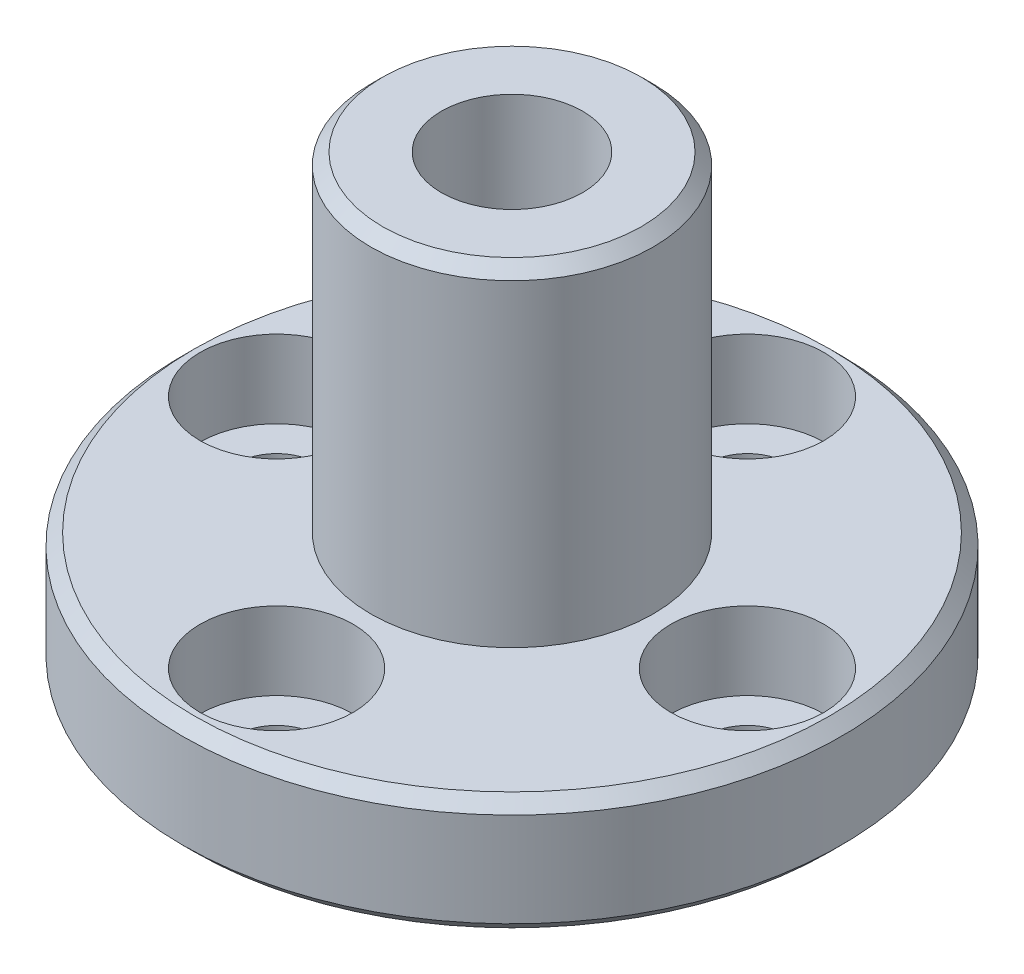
ISO-10303-21;
HEADER;
FILE_DESCRIPTION(('STEP AP214'),'2;1');
FILE_NAME('part.step','',(''),(''),'','','');
FILE_SCHEMA(('AUTOMOTIVE_DESIGN { 1 0 10303 214 1 1 1 1 }'));
ENDSEC;
DATA;
#1=APPLICATION_CONTEXT('core data for automotive mechanical design processes');
#2=APPLICATION_PROTOCOL_DEFINITION('international standard','automotive_design',2000,#1);
#3=PRODUCT_CONTEXT('',#1,'mechanical');
#4=PRODUCT('Part','Part','',(#3));
#5=PRODUCT_RELATED_PRODUCT_CATEGORY('part','',(#4));
#6=PRODUCT_DEFINITION_FORMATION('','',#4);
#7=PRODUCT_DEFINITION_CONTEXT('part definition',#1,'design');
#8=PRODUCT_DEFINITION('design','',#6,#7);
#9=PRODUCT_DEFINITION_SHAPE('','',#8);
#10=(LENGTH_UNIT() NAMED_UNIT(*) SI_UNIT(.MILLI.,.METRE.));
#11=(NAMED_UNIT(*) PLANE_ANGLE_UNIT() SI_UNIT($,.RADIAN.));
#12=(NAMED_UNIT(*) SI_UNIT($,.STERADIAN.) SOLID_ANGLE_UNIT());
#13=UNCERTAINTY_MEASURE_WITH_UNIT(LENGTH_MEASURE(1.E-05),#10,'distance_accuracy_value','');
#14=(GEOMETRIC_REPRESENTATION_CONTEXT(3) GLOBAL_UNCERTAINTY_ASSIGNED_CONTEXT((#13)) GLOBAL_UNIT_ASSIGNED_CONTEXT((#10,
#11,#12)) REPRESENTATION_CONTEXT('',''));
#15=CARTESIAN_POINT('',(0.,0.,0.));
#16=DIRECTION('',(0.,0.,1.));
#17=DIRECTION('',(1.,0.,0.));
#18=AXIS2_PLACEMENT_3D('',#15,#16,#17);
#19=CARTESIAN_POINT('',(0.,0.,0.));
#20=DIRECTION('',(0.,1.,0.));
#21=DIRECTION('',(0.,0.,1.));
#22=AXIS2_PLACEMENT_3D('',#19,#20,#21);
#23=CONICAL_SURFACE('',#22,13.5,0.785398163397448);
#24=CARTESIAN_POINT('',(0.,0.499999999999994,0.));
#25=DIRECTION('',(0.,1.,0.));
#26=DIRECTION('',(0.,0.,1.));
#27=AXIS2_PLACEMENT_3D('',#24,#25,#26);
#28=CIRCLE('',#27,14.);
#29=CARTESIAN_POINT('',(0.,0.499999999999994,14.));
#30=VERTEX_POINT('',#29);
#31=CARTESIAN_POINT('',(0.,0.5,-14.));
#32=VERTEX_POINT('',#31);
#33=EDGE_CURVE('E259',#30,#32,#28,.T.);
#34=ORIENTED_EDGE('',*,*,#33,.F.);
#35=CARTESIAN_POINT('',(0.,0.499999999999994,0.));
#36=DIRECTION('',(0.,1.,0.));
#37=DIRECTION('',(0.,0.,1.));
#38=AXIS2_PLACEMENT_3D('',#35,#36,#37);
#39=CIRCLE('',#38,14.);
#40=EDGE_CURVE('E254',#32,#30,#39,.T.);
#41=ORIENTED_EDGE('',*,*,#40,.F.);
#42=DIRECTION('',(0.,-0.707106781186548,0.707106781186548));
#43=VECTOR('',#42,1.);
#44=CARTESIAN_POINT('',(0.,0.,-13.5));
#45=LINE('',#44,#43);
#46=CARTESIAN_POINT('',(0.,0.,-13.5));
#47=VERTEX_POINT('',#46);
#48=EDGE_CURVE('E10',#32,#47,#45,.T.);
#49=ORIENTED_EDGE('',*,*,#48,.T.);
#50=CARTESIAN_POINT('',(0.,0.,0.));
#51=DIRECTION('',(0.,-1.,0.));
#52=DIRECTION('',(0.,0.,1.));
#53=AXIS2_PLACEMENT_3D('',#50,#51,#52);
#54=CIRCLE('',#53,13.5);
#55=CARTESIAN_POINT('',(0.,0.,13.5));
#56=VERTEX_POINT('',#55);
#57=EDGE_CURVE('E241',#56,#47,#54,.T.);
#58=ORIENTED_EDGE('',*,*,#57,.F.);
#59=CARTESIAN_POINT('',(0.,0.,0.));
#60=DIRECTION('',(0.,-1.,0.));
#61=DIRECTION('',(0.,0.,1.));
#62=AXIS2_PLACEMENT_3D('',#59,#60,#61);
#63=CIRCLE('',#62,13.5);
#64=EDGE_CURVE('E238',#47,#56,#63,.T.);
#65=ORIENTED_EDGE('',*,*,#64,.F.);
#66=ORIENTED_EDGE('',*,*,#48,.F.);
#67=EDGE_LOOP('',(#34,#41,#49,#58,#65,#66));
#68=FACE_BOUND('',#67,.T.);
#69=ADVANCED_FACE('F16',(#68),#23,.T.);
#70=CARTESIAN_POINT('',(0.,4.5,0.));
#71=DIRECTION('',(0.,-1.,0.));
#72=DIRECTION('',(0.,0.,-1.));
#73=AXIS2_PLACEMENT_3D('',#70,#71,#72);
#74=CONICAL_SURFACE('',#73,14.,0.785398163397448);
#75=CARTESIAN_POINT('',(0.,4.5,0.));
#76=DIRECTION('',(0.,-1.,0.));
#77=DIRECTION('',(0.,0.,-1.));
#78=AXIS2_PLACEMENT_3D('',#75,#76,#77);
#79=CIRCLE('',#78,14.);
#80=CARTESIAN_POINT('',(0.,4.5,-14.));
#81=VERTEX_POINT('',#80);
#82=CARTESIAN_POINT('',(0.,4.5,14.));
#83=VERTEX_POINT('',#82);
#84=EDGE_CURVE('E309',#81,#83,#79,.T.);
#85=ORIENTED_EDGE('',*,*,#84,.F.);
#86=CARTESIAN_POINT('',(0.,4.5,0.));
#87=DIRECTION('',(0.,-1.,0.));
#88=DIRECTION('',(0.,0.,-1.));
#89=AXIS2_PLACEMENT_3D('',#86,#87,#88);
#90=CIRCLE('',#89,14.);
#91=EDGE_CURVE('E305',#83,#81,#90,.T.);
#92=ORIENTED_EDGE('',*,*,#91,.F.);
#93=DIRECTION('',(0.,0.707106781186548,-0.707106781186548));
#94=VECTOR('',#93,1.);
#95=CARTESIAN_POINT('',(0.,4.5,14.));
#96=LINE('',#95,#94);
#97=CARTESIAN_POINT('',(0.,5.,13.5));
#98=VERTEX_POINT('',#97);
#99=EDGE_CURVE('E24',#83,#98,#96,.T.);
#100=ORIENTED_EDGE('',*,*,#99,.T.);
#101=CARTESIAN_POINT('',(0.,5.,0.));
#102=DIRECTION('',(0.,1.,0.));
#103=DIRECTION('',(0.,0.,-1.));
#104=AXIS2_PLACEMENT_3D('',#101,#102,#103);
#105=CIRCLE('',#104,13.5);
#106=CARTESIAN_POINT('',(0.,5.,-13.5));
#107=VERTEX_POINT('',#106);
#108=EDGE_CURVE('E338',#107,#98,#105,.T.);
#109=ORIENTED_EDGE('',*,*,#108,.F.);
#110=CARTESIAN_POINT('',(0.,5.,0.));
#111=DIRECTION('',(0.,1.,0.));
#112=DIRECTION('',(0.,0.,-1.));
#113=AXIS2_PLACEMENT_3D('',#110,#111,#112);
#114=CIRCLE('',#113,13.5);
#115=EDGE_CURVE('E342',#98,#107,#114,.T.);
#116=ORIENTED_EDGE('',*,*,#115,.F.);
#117=ORIENTED_EDGE('',*,*,#99,.F.);
#118=EDGE_LOOP('',(#85,#92,#100,#109,#116,#117));
#119=FACE_BOUND('',#118,.T.);
#120=ADVANCED_FACE('F468',(#119),#74,.T.);
#121=CARTESIAN_POINT('',(0.,18.5,0.));
#122=DIRECTION('',(0.,-1.,0.));
#123=DIRECTION('',(0.,0.,-1.));
#124=AXIS2_PLACEMENT_3D('',#121,#122,#123);
#125=CONICAL_SURFACE('',#124,6.,0.785398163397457);
#126=CARTESIAN_POINT('',(0.,18.5,0.));
#127=DIRECTION('',(0.,-1.,0.));
#128=DIRECTION('',(0.,0.,-1.));
#129=AXIS2_PLACEMENT_3D('',#126,#127,#128);
#130=CIRCLE('',#129,6.);
#131=CARTESIAN_POINT('',(0.,18.5,-6.));
#132=VERTEX_POINT('',#131);
#133=CARTESIAN_POINT('',(0.,18.5,6.));
#134=VERTEX_POINT('',#133);
#135=EDGE_CURVE('E388',#132,#134,#130,.T.);
#136=ORIENTED_EDGE('',*,*,#135,.F.);
#137=CARTESIAN_POINT('',(0.,18.5,0.));
#138=DIRECTION('',(0.,-1.,0.));
#139=DIRECTION('',(0.,0.,-1.));
#140=AXIS2_PLACEMENT_3D('',#137,#138,#139);
#141=CIRCLE('',#140,6.);
#142=EDGE_CURVE('E381',#134,#132,#141,.T.);
#143=ORIENTED_EDGE('',*,*,#142,.F.);
#144=DIRECTION('',(0.,0.707106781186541,-0.707106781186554));
#145=VECTOR('',#144,1.);
#146=CARTESIAN_POINT('',(0.,18.5,6.));
#147=LINE('',#146,#145);
#148=CARTESIAN_POINT('',(0.,19.,5.5));
#149=VERTEX_POINT('',#148);
#150=EDGE_CURVE('E384',#134,#149,#147,.T.);
#151=ORIENTED_EDGE('',*,*,#150,.T.);
#152=CARTESIAN_POINT('',(0.,19.,0.));
#153=DIRECTION('',(0.,1.,0.));
#154=DIRECTION('',(0.,0.,-1.));
#155=AXIS2_PLACEMENT_3D('',#152,#153,#154);
#156=CIRCLE('',#155,5.5);
#157=CARTESIAN_POINT('',(0.,19.,-5.5));
#158=VERTEX_POINT('',#157);
#159=EDGE_CURVE('E392',#158,#149,#156,.T.);
#160=ORIENTED_EDGE('',*,*,#159,.F.);
#161=CARTESIAN_POINT('',(0.,19.,0.));
#162=DIRECTION('',(0.,1.,0.));
#163=DIRECTION('',(0.,0.,-1.));
#164=AXIS2_PLACEMENT_3D('',#161,#162,#163);
#165=CIRCLE('',#164,5.5);
#166=EDGE_CURVE('E396',#149,#158,#165,.T.);
#167=ORIENTED_EDGE('',*,*,#166,.F.);
#168=ORIENTED_EDGE('',*,*,#150,.F.);
#169=EDGE_LOOP('',(#136,#143,#151,#160,#167,#168));
#170=FACE_BOUND('',#169,.T.);
#171=ADVANCED_FACE('F492',(#170),#125,.T.);
#172=CARTESIAN_POINT('',(0.,5.,-10.));
#173=DIRECTION('',(0.,1.,0.));
#174=DIRECTION('',(0.,0.,1.));
#175=AXIS2_PLACEMENT_3D('',#172,#173,#174);
#176=CYLINDRICAL_SURFACE('',#175,3.25);
#177=CARTESIAN_POINT('',(0.,1.7,-10.));
#178=DIRECTION('',(0.,1.,0.));
#179=DIRECTION('',(0.,0.,1.));
#180=AXIS2_PLACEMENT_3D('',#177,#178,#179);
#181=CIRCLE('',#180,3.25);
#182=CARTESIAN_POINT('',(0.,1.7,-6.75));
#183=VERTEX_POINT('',#182);
#184=CARTESIAN_POINT('',(0.,1.7,-13.25));
#185=VERTEX_POINT('',#184);
#186=EDGE_CURVE('E352',#183,#185,#181,.T.);
#187=ORIENTED_EDGE('',*,*,#186,.F.);
#188=CARTESIAN_POINT('',(0.,1.7,-10.));
#189=DIRECTION('',(0.,1.,0.));
#190=DIRECTION('',(0.,0.,1.));
#191=AXIS2_PLACEMENT_3D('',#188,#189,#190);
#192=CIRCLE('',#191,3.25);
#193=EDGE_CURVE('E44',#185,#183,#192,.T.);
#194=ORIENTED_EDGE('',*,*,#193,.F.);
#195=DIRECTION('',(0.,1.,0.));
#196=VECTOR('',#195,1.);
#197=CARTESIAN_POINT('',(0.,5.,-13.25));
#198=LINE('',#197,#196);
#199=CARTESIAN_POINT('',(0.,5.,-13.25));
#200=VERTEX_POINT('',#199);
#201=EDGE_CURVE('E36',#185,#200,#198,.T.);
#202=ORIENTED_EDGE('',*,*,#201,.T.);
#203=CARTESIAN_POINT('',(0.,5.,-10.));
#204=DIRECTION('',(0.,1.,0.));
#205=DIRECTION('',(0.,0.,1.));
#206=AXIS2_PLACEMENT_3D('',#203,#204,#205);
#207=CIRCLE('',#206,3.25);
#208=CARTESIAN_POINT('',(0.,5.,-6.75));
#209=VERTEX_POINT('',#208);
#210=EDGE_CURVE('E348',#200,#209,#207,.T.);
#211=ORIENTED_EDGE('',*,*,#210,.T.);
#212=CARTESIAN_POINT('',(0.,5.,-10.));
#213=DIRECTION('',(0.,1.,0.));
#214=DIRECTION('',(0.,0.,1.));
#215=AXIS2_PLACEMENT_3D('',#212,#213,#214);
#216=CIRCLE('',#215,3.25);
#217=EDGE_CURVE('E345',#209,#200,#216,.T.);
#218=ORIENTED_EDGE('',*,*,#217,.T.);
#219=ORIENTED_EDGE('',*,*,#201,.F.);
#220=EDGE_LOOP('',(#187,#194,#202,#211,#218,#219));
#221=FACE_BOUND('',#220,.T.);
#222=ADVANCED_FACE('F496',(#221),#176,.F.);
#223=CARTESIAN_POINT('',(1.7,1.7,-10.));
#224=DIRECTION('',(0.,-1.,0.));
#225=DIRECTION('',(0.,0.,-1.));
#226=AXIS2_PLACEMENT_3D('',#223,#224,#225);
#227=PLANE('',#226);
#228=CARTESIAN_POINT('',(0.,1.7,-10.));
#229=DIRECTION('',(0.,1.,0.));
#230=DIRECTION('',(0.,0.,1.));
#231=AXIS2_PLACEMENT_3D('',#228,#229,#230);
#232=CIRCLE('',#231,1.7);
#233=CARTESIAN_POINT('',(0.,1.7,-8.3));
#234=VERTEX_POINT('',#233);
#235=CARTESIAN_POINT('',(0.,1.7,-11.7));
#236=VERTEX_POINT('',#235);
#237=EDGE_CURVE('E349',#234,#236,#232,.T.);
#238=ORIENTED_EDGE('',*,*,#237,.F.);
#239=CARTESIAN_POINT('',(0.,1.7,-10.));
#240=DIRECTION('',(0.,1.,0.));
#241=DIRECTION('',(0.,0.,1.));
#242=AXIS2_PLACEMENT_3D('',#239,#240,#241);
#243=CIRCLE('',#242,1.7);
#244=EDGE_CURVE('E353',#236,#234,#243,.T.);
#245=ORIENTED_EDGE('',*,*,#244,.F.);
#246=EDGE_LOOP('',(#238,#245));
#247=FACE_BOUND('',#246,.T.);
#248=ORIENTED_EDGE('',*,*,#186,.T.);
#249=ORIENTED_EDGE('',*,*,#193,.T.);
#250=EDGE_LOOP('',(#248,#249));
#251=FACE_BOUND('',#250,.T.);
#252=ADVANCED_FACE('F502',(#247,#251),#227,.F.);
#253=CARTESIAN_POINT('',(0.,5.,-10.));
#254=DIRECTION('',(0.,1.,0.));
#255=DIRECTION('',(0.,0.,1.));
#256=AXIS2_PLACEMENT_3D('',#253,#254,#255);
#257=CYLINDRICAL_SURFACE('',#256,1.7);
#258=CARTESIAN_POINT('',(0.,0.,-10.));
#259=DIRECTION('',(0.,1.,0.));
#260=DIRECTION('',(0.,0.,1.));
#261=AXIS2_PLACEMENT_3D('',#258,#259,#260);
#262=CIRCLE('',#261,1.7);
#263=CARTESIAN_POINT('',(0.,0.,-8.3));
#264=VERTEX_POINT('',#263);
#265=CARTESIAN_POINT('',(0.,0.,-11.7));
#266=VERTEX_POINT('',#265);
#267=EDGE_CURVE('E244',#264,#266,#262,.T.);
#268=ORIENTED_EDGE('',*,*,#267,.F.);
#269=CARTESIAN_POINT('',(0.,0.,-10.));
#270=DIRECTION('',(0.,1.,0.));
#271=DIRECTION('',(0.,0.,1.));
#272=AXIS2_PLACEMENT_3D('',#269,#270,#271);
#273=CIRCLE('',#272,1.7);
#274=EDGE_CURVE('E274',#266,#264,#273,.T.);
#275=ORIENTED_EDGE('',*,*,#274,.F.);
#276=DIRECTION('',(0.,1.,0.));
#277=VECTOR('',#276,1.);
#278=CARTESIAN_POINT('',(0.,5.,-11.7));
#279=LINE('',#278,#277);
#280=EDGE_CURVE('E449',#266,#236,#279,.T.);
#281=ORIENTED_EDGE('',*,*,#280,.T.);
#282=ORIENTED_EDGE('',*,*,#244,.T.);
#283=ORIENTED_EDGE('',*,*,#237,.T.);
#284=ORIENTED_EDGE('',*,*,#280,.F.);
#285=EDGE_LOOP('',(#268,#275,#281,#282,#283,#284));
#286=FACE_BOUND('',#285,.T.);
#287=ADVANCED_FACE('F505',(#286),#257,.F.);
#288=CARTESIAN_POINT('',(10.,5.,0.));
#289=DIRECTION('',(0.,1.,0.));
#290=DIRECTION('',(0.,0.,1.));
#291=AXIS2_PLACEMENT_3D('',#288,#289,#290);
#292=CYLINDRICAL_SURFACE('',#291,3.25);
#293=CARTESIAN_POINT('',(10.,1.7,0.));
#294=DIRECTION('',(0.,1.,0.));
#295=DIRECTION('',(0.,0.,1.));
#296=AXIS2_PLACEMENT_3D('',#293,#294,#295);
#297=CIRCLE('',#296,3.25);
#298=CARTESIAN_POINT('',(10.,1.7,3.25));
#299=VERTEX_POINT('',#298);
#300=CARTESIAN_POINT('',(10.,1.7,-3.25));
#301=VERTEX_POINT('',#300);
#302=EDGE_CURVE('E431',#299,#301,#297,.T.);
#303=ORIENTED_EDGE('',*,*,#302,.F.);
#304=CARTESIAN_POINT('',(10.,1.7,0.));
#305=DIRECTION('',(0.,1.,0.));
#306=DIRECTION('',(0.,0.,1.));
#307=AXIS2_PLACEMENT_3D('',#304,#305,#306);
#308=CIRCLE('',#307,3.25);
#309=EDGE_CURVE('E427',#301,#299,#308,.T.);
#310=ORIENTED_EDGE('',*,*,#309,.F.);
#311=DIRECTION('',(0.,1.,0.));
#312=VECTOR('',#311,1.);
#313=CARTESIAN_POINT('',(10.,5.,-3.25));
#314=LINE('',#313,#312);
#315=CARTESIAN_POINT('',(10.,5.,-3.25));
#316=VERTEX_POINT('',#315);
#317=EDGE_CURVE('E430',#301,#316,#314,.T.);
#318=ORIENTED_EDGE('',*,*,#317,.T.);
#319=CARTESIAN_POINT('',(10.,5.,0.));
#320=DIRECTION('',(0.,1.,0.));
#321=DIRECTION('',(0.,0.,1.));
#322=AXIS2_PLACEMENT_3D('',#319,#320,#321);
#323=CIRCLE('',#322,3.25);
#324=CARTESIAN_POINT('',(10.,5.,3.25));
#325=VERTEX_POINT('',#324);
#326=EDGE_CURVE('E280',#316,#325,#323,.T.);
#327=ORIENTED_EDGE('',*,*,#326,.T.);
#328=CARTESIAN_POINT('',(10.,5.,0.));
#329=DIRECTION('',(0.,1.,0.));
#330=DIRECTION('',(0.,0.,1.));
#331=AXIS2_PLACEMENT_3D('',#328,#329,#330);
#332=CIRCLE('',#331,3.25);
#333=EDGE_CURVE('E284',#325,#316,#332,.T.);
#334=ORIENTED_EDGE('',*,*,#333,.T.);
#335=ORIENTED_EDGE('',*,*,#317,.F.);
#336=EDGE_LOOP('',(#303,#310,#318,#327,#334,#335));
#337=FACE_BOUND('',#336,.T.);
#338=ADVANCED_FACE('F509',(#337),#292,.F.);
#339=CARTESIAN_POINT('',(11.7,1.7,0.));
#340=DIRECTION('',(0.,-1.,0.));
#341=DIRECTION('',(0.,0.,-1.));
#342=AXIS2_PLACEMENT_3D('',#339,#340,#341);
#343=PLANE('',#342);
#344=CARTESIAN_POINT('',(10.,1.7,0.));
#345=DIRECTION('',(0.,1.,0.));
#346=DIRECTION('',(0.,0.,1.));
#347=AXIS2_PLACEMENT_3D('',#344,#345,#346);
#348=CIRCLE('',#347,1.7);
#349=CARTESIAN_POINT('',(10.,1.7,1.7));
#350=VERTEX_POINT('',#349);
#351=CARTESIAN_POINT('',(10.,1.7,-1.7));
#352=VERTEX_POINT('',#351);
#353=EDGE_CURVE('E441',#350,#352,#348,.T.);
#354=ORIENTED_EDGE('',*,*,#353,.F.);
#355=CARTESIAN_POINT('',(10.,1.7,0.));
#356=DIRECTION('',(0.,1.,0.));
#357=DIRECTION('',(0.,0.,1.));
#358=AXIS2_PLACEMENT_3D('',#355,#356,#357);
#359=CIRCLE('',#358,1.7);
#360=EDGE_CURVE('E437',#352,#350,#359,.T.);
#361=ORIENTED_EDGE('',*,*,#360,.F.);
#362=EDGE_LOOP('',(#354,#361));
#363=FACE_BOUND('',#362,.T.);
#364=ORIENTED_EDGE('',*,*,#302,.T.);
#365=ORIENTED_EDGE('',*,*,#309,.T.);
#366=EDGE_LOOP('',(#364,#365));
#367=FACE_BOUND('',#366,.T.);
#368=ADVANCED_FACE('F511',(#363,#367),#343,.F.);
#369=CARTESIAN_POINT('',(10.,5.,0.));
#370=DIRECTION('',(0.,1.,0.));
#371=DIRECTION('',(0.,0.,1.));
#372=AXIS2_PLACEMENT_3D('',#369,#370,#371);
#373=CYLINDRICAL_SURFACE('',#372,1.7);
#374=CARTESIAN_POINT('',(10.,0.,0.));
#375=DIRECTION('',(0.,1.,0.));
#376=DIRECTION('',(0.,0.,1.));
#377=AXIS2_PLACEMENT_3D('',#374,#375,#376);
#378=CIRCLE('',#377,1.7);
#379=CARTESIAN_POINT('',(10.,0.,1.7));
#380=VERTEX_POINT('',#379);
#381=CARTESIAN_POINT('',(10.,0.,-1.7));
#382=VERTEX_POINT('',#381);
#383=EDGE_CURVE('E277',#380,#382,#378,.T.);
#384=ORIENTED_EDGE('',*,*,#383,.F.);
#385=CARTESIAN_POINT('',(10.,0.,0.));
#386=DIRECTION('',(0.,1.,0.));
#387=DIRECTION('',(0.,0.,1.));
#388=AXIS2_PLACEMENT_3D('',#385,#386,#387);
#389=CIRCLE('',#388,1.7);
#390=EDGE_CURVE('E269',#382,#380,#389,.T.);
#391=ORIENTED_EDGE('',*,*,#390,.F.);
#392=DIRECTION('',(0.,1.,0.));
#393=VECTOR('',#392,1.);
#394=CARTESIAN_POINT('',(10.,5.,-1.7));
#395=LINE('',#394,#393);
#396=EDGE_CURVE('E295',#382,#352,#395,.T.);
#397=ORIENTED_EDGE('',*,*,#396,.T.);
#398=ORIENTED_EDGE('',*,*,#360,.T.);
#399=ORIENTED_EDGE('',*,*,#353,.T.);
#400=ORIENTED_EDGE('',*,*,#396,.F.);
#401=EDGE_LOOP('',(#384,#391,#397,#398,#399,#400));
#402=FACE_BOUND('',#401,.T.);
#403=ADVANCED_FACE('F514',(#402),#373,.F.);
#404=CARTESIAN_POINT('',(0.,5.,10.));
#405=DIRECTION('',(0.,1.,0.));
#406=DIRECTION('',(0.,0.,1.));
#407=AXIS2_PLACEMENT_3D('',#404,#405,#406);
#408=CYLINDRICAL_SURFACE('',#407,3.25);
#409=CARTESIAN_POINT('',(0.,1.7,10.));
#410=DIRECTION('',(0.,1.,0.));
#411=DIRECTION('',(0.,0.,1.));
#412=AXIS2_PLACEMENT_3D('',#409,#410,#411);
#413=CIRCLE('',#412,3.25);
#414=CARTESIAN_POINT('',(0.,1.7,13.25));
#415=VERTEX_POINT('',#414);
#416=CARTESIAN_POINT('',(0.,1.7,6.75));
#417=VERTEX_POINT('',#416);
#418=EDGE_CURVE('E423',#415,#417,#413,.T.);
#419=ORIENTED_EDGE('',*,*,#418,.F.);
#420=CARTESIAN_POINT('',(0.,1.7,10.));
#421=DIRECTION('',(0.,1.,0.));
#422=DIRECTION('',(0.,0.,1.));
#423=AXIS2_PLACEMENT_3D('',#420,#421,#422);
#424=CIRCLE('',#423,3.25);
#425=EDGE_CURVE('E296',#417,#415,#424,.T.);
#426=ORIENTED_EDGE('',*,*,#425,.F.);
#427=DIRECTION('',(0.,1.,0.));
#428=VECTOR('',#427,1.);
#429=CARTESIAN_POINT('',(0.,5.,6.75));
#430=LINE('',#429,#428);
#431=CARTESIAN_POINT('',(0.,5.,6.75));
#432=VERTEX_POINT('',#431);
#433=EDGE_CURVE('E292',#417,#432,#430,.T.);
#434=ORIENTED_EDGE('',*,*,#433,.T.);
#435=CARTESIAN_POINT('',(0.,5.,10.));
#436=DIRECTION('',(0.,1.,0.));
#437=DIRECTION('',(0.,0.,1.));
#438=AXIS2_PLACEMENT_3D('',#435,#436,#437);
#439=CIRCLE('',#438,3.25);
#440=CARTESIAN_POINT('',(0.,5.,13.25));
#441=VERTEX_POINT('',#440);
#442=EDGE_CURVE('E362',#432,#441,#439,.T.);
#443=ORIENTED_EDGE('',*,*,#442,.T.);
#444=CARTESIAN_POINT('',(0.,5.,10.));
#445=DIRECTION('',(0.,1.,0.));
#446=DIRECTION('',(0.,0.,1.));
#447=AXIS2_PLACEMENT_3D('',#444,#445,#446);
#448=CIRCLE('',#447,3.25);
#449=EDGE_CURVE('E283',#441,#432,#448,.T.);
#450=ORIENTED_EDGE('',*,*,#449,.T.);
#451=ORIENTED_EDGE('',*,*,#433,.F.);
#452=EDGE_LOOP('',(#419,#426,#434,#443,#450,#451));
#453=FACE_BOUND('',#452,.T.);
#454=ADVANCED_FACE('F520',(#453),#408,.F.);
#455=CARTESIAN_POINT('',(1.7,1.7,10.));
#456=DIRECTION('',(0.,-1.,0.));
#457=DIRECTION('',(0.,0.,-1.));
#458=AXIS2_PLACEMENT_3D('',#455,#456,#457);
#459=PLANE('',#458);
#460=CARTESIAN_POINT('',(0.,1.7,10.));
#461=DIRECTION('',(0.,1.,0.));
#462=DIRECTION('',(0.,0.,1.));
#463=AXIS2_PLACEMENT_3D('',#460,#461,#462);
#464=CIRCLE('',#463,1.7);
#465=CARTESIAN_POINT('',(0.,1.7,11.7));
#466=VERTEX_POINT('',#465);
#467=CARTESIAN_POINT('',(0.,1.7,8.3));
#468=VERTEX_POINT('',#467);
#469=EDGE_CURVE('E314',#466,#468,#464,.T.);
#470=ORIENTED_EDGE('',*,*,#469,.F.);
#471=CARTESIAN_POINT('',(0.,1.7,10.));
#472=DIRECTION('',(0.,1.,0.));
#473=DIRECTION('',(0.,0.,1.));
#474=AXIS2_PLACEMENT_3D('',#471,#472,#473);
#475=CIRCLE('',#474,1.7);
#476=EDGE_CURVE('E310',#468,#466,#475,.T.);
#477=ORIENTED_EDGE('',*,*,#476,.F.);
#478=EDGE_LOOP('',(#470,#477));
#479=FACE_BOUND('',#478,.T.);
#480=ORIENTED_EDGE('',*,*,#418,.T.);
#481=ORIENTED_EDGE('',*,*,#425,.T.);
#482=EDGE_LOOP('',(#480,#481));
#483=FACE_BOUND('',#482,.T.);
#484=ADVANCED_FACE('F516',(#479,#483),#459,.F.);
#485=CARTESIAN_POINT('',(0.,5.,10.));
#486=DIRECTION('',(0.,1.,0.));
#487=DIRECTION('',(0.,0.,1.));
#488=AXIS2_PLACEMENT_3D('',#485,#486,#487);
#489=CYLINDRICAL_SURFACE('',#488,1.7);
#490=CARTESIAN_POINT('',(0.,0.,10.));
#491=DIRECTION('',(0.,1.,0.));
#492=DIRECTION('',(0.,0.,1.));
#493=AXIS2_PLACEMENT_3D('',#490,#491,#492);
#494=CIRCLE('',#493,1.7);
#495=CARTESIAN_POINT('',(0.,0.,11.7));
#496=VERTEX_POINT('',#495);
#497=CARTESIAN_POINT('',(0.,0.,8.3));
#498=VERTEX_POINT('',#497);
#499=EDGE_CURVE('E265',#496,#498,#494,.T.);
#500=ORIENTED_EDGE('',*,*,#499,.F.);
#501=CARTESIAN_POINT('',(0.,0.,10.));
#502=DIRECTION('',(0.,1.,0.));
#503=DIRECTION('',(0.,0.,1.));
#504=AXIS2_PLACEMENT_3D('',#501,#502,#503);
#505=CIRCLE('',#504,1.7);
#506=EDGE_CURVE('E268',#498,#496,#505,.T.);
#507=ORIENTED_EDGE('',*,*,#506,.F.);
#508=DIRECTION('',(0.,1.,0.));
#509=VECTOR('',#508,1.);
#510=CARTESIAN_POINT('',(0.,5.,8.3));
#511=LINE('',#510,#509);
#512=EDGE_CURVE('E300',#498,#468,#511,.T.);
#513=ORIENTED_EDGE('',*,*,#512,.T.);
#514=ORIENTED_EDGE('',*,*,#476,.T.);
#515=ORIENTED_EDGE('',*,*,#469,.T.);
#516=ORIENTED_EDGE('',*,*,#512,.F.);
#517=EDGE_LOOP('',(#500,#507,#513,#514,#515,#516));
#518=FACE_BOUND('',#517,.T.);
#519=ADVANCED_FACE('F519',(#518),#489,.F.);
#520=CARTESIAN_POINT('',(-10.,5.,0.));
#521=DIRECTION('',(0.,1.,0.));
#522=DIRECTION('',(0.,0.,1.));
#523=AXIS2_PLACEMENT_3D('',#520,#521,#522);
#524=CYLINDRICAL_SURFACE('',#523,3.25);
#525=CARTESIAN_POINT('',(-10.,1.7,0.));
#526=DIRECTION('',(0.,1.,0.));
#527=DIRECTION('',(0.,0.,1.));
#528=AXIS2_PLACEMENT_3D('',#525,#526,#527);
#529=CIRCLE('',#528,3.25);
#530=CARTESIAN_POINT('',(-10.,1.7,3.25));
#531=VERTEX_POINT('',#530);
#532=CARTESIAN_POINT('',(-10.,1.7,-3.25));
#533=VERTEX_POINT('',#532);
#534=EDGE_CURVE('E412',#531,#533,#529,.T.);
#535=ORIENTED_EDGE('',*,*,#534,.F.);
#536=CARTESIAN_POINT('',(-10.,1.7,0.));
#537=DIRECTION('',(0.,1.,0.));
#538=DIRECTION('',(0.,0.,1.));
#539=AXIS2_PLACEMENT_3D('',#536,#537,#538);
#540=CIRCLE('',#539,3.25);
#541=EDGE_CURVE('E301',#533,#531,#540,.T.);
#542=ORIENTED_EDGE('',*,*,#541,.F.);
#543=DIRECTION('',(0.,1.,0.));
#544=VECTOR('',#543,1.);
#545=CARTESIAN_POINT('',(-10.,5.,-3.25));
#546=LINE('',#545,#544);
#547=CARTESIAN_POINT('',(-10.,5.,-3.25));
#548=VERTEX_POINT('',#547);
#549=EDGE_CURVE('E297',#533,#548,#546,.T.);
#550=ORIENTED_EDGE('',*,*,#549,.T.);
#551=CARTESIAN_POINT('',(-10.,5.,0.));
#552=DIRECTION('',(0.,1.,0.));
#553=DIRECTION('',(0.,0.,1.));
#554=AXIS2_PLACEMENT_3D('',#551,#552,#553);
#555=CIRCLE('',#554,3.25);
#556=CARTESIAN_POINT('',(-10.,5.,3.25));
#557=VERTEX_POINT('',#556);
#558=EDGE_CURVE('E322',#548,#557,#555,.T.);
#559=ORIENTED_EDGE('',*,*,#558,.T.);
#560=CARTESIAN_POINT('',(-10.,5.,0.));
#561=DIRECTION('',(0.,1.,0.));
#562=DIRECTION('',(0.,0.,1.));
#563=AXIS2_PLACEMENT_3D('',#560,#561,#562);
#564=CIRCLE('',#563,3.25);
#565=EDGE_CURVE('E326',#557,#548,#564,.T.);
#566=ORIENTED_EDGE('',*,*,#565,.T.);
#567=ORIENTED_EDGE('',*,*,#549,.F.);
#568=EDGE_LOOP('',(#535,#542,#550,#559,#566,#567));
#569=FACE_BOUND('',#568,.T.);
#570=ADVANCED_FACE('F533',(#569),#524,.F.);
#571=CARTESIAN_POINT('',(-8.3,1.7,0.));
#572=DIRECTION('',(0.,-1.,0.));
#573=DIRECTION('',(0.,0.,-1.));
#574=AXIS2_PLACEMENT_3D('',#571,#572,#573);
#575=PLANE('',#574);
#576=CARTESIAN_POINT('',(-10.,1.7,0.));
#577=DIRECTION('',(0.,1.,0.));
#578=DIRECTION('',(0.,0.,1.));
#579=AXIS2_PLACEMENT_3D('',#576,#577,#578);
#580=CIRCLE('',#579,1.7);
#581=CARTESIAN_POINT('',(-10.,1.7,1.7));
#582=VERTEX_POINT('',#581);
#583=CARTESIAN_POINT('',(-10.,1.7,-1.7));
#584=VERTEX_POINT('',#583);
#585=EDGE_CURVE('E409',#582,#584,#580,.T.);
#586=ORIENTED_EDGE('',*,*,#585,.F.);
#587=CARTESIAN_POINT('',(-10.,1.7,0.));
#588=DIRECTION('',(0.,1.,0.));
#589=DIRECTION('',(0.,0.,1.));
#590=AXIS2_PLACEMENT_3D('',#587,#588,#589);
#591=CIRCLE('',#590,1.7);
#592=EDGE_CURVE('E405',#584,#582,#591,.T.);
#593=ORIENTED_EDGE('',*,*,#592,.F.);
#594=EDGE_LOOP('',(#586,#593));
#595=FACE_BOUND('',#594,.T.);
#596=ORIENTED_EDGE('',*,*,#534,.T.);
#597=ORIENTED_EDGE('',*,*,#541,.T.);
#598=EDGE_LOOP('',(#596,#597));
#599=FACE_BOUND('',#598,.T.);
#600=ADVANCED_FACE('F529',(#595,#599),#575,.F.);
#601=CARTESIAN_POINT('',(-10.,5.,0.));
#602=DIRECTION('',(0.,1.,0.));
#603=DIRECTION('',(0.,0.,1.));
#604=AXIS2_PLACEMENT_3D('',#601,#602,#603);
#605=CYLINDRICAL_SURFACE('',#604,1.7);
#606=CARTESIAN_POINT('',(-10.,0.,0.));
#607=DIRECTION('',(0.,1.,0.));
#608=DIRECTION('',(0.,0.,1.));
#609=AXIS2_PLACEMENT_3D('',#606,#607,#608);
#610=CIRCLE('',#609,1.7);
#611=CARTESIAN_POINT('',(-10.,0.,1.7));
#612=VERTEX_POINT('',#611);
#613=CARTESIAN_POINT('',(-10.,0.,-1.7));
#614=VERTEX_POINT('',#613);
#615=EDGE_CURVE('E304',#612,#614,#610,.T.);
#616=ORIENTED_EDGE('',*,*,#615,.F.);
#617=CARTESIAN_POINT('',(-10.,0.,0.));
#618=DIRECTION('',(0.,1.,0.));
#619=DIRECTION('',(0.,0.,1.));
#620=AXIS2_PLACEMENT_3D('',#617,#618,#619);
#621=CIRCLE('',#620,1.7);
#622=EDGE_CURVE('E318',#614,#612,#621,.T.);
#623=ORIENTED_EDGE('',*,*,#622,.F.);
#624=DIRECTION('',(0.,1.,0.));
#625=VECTOR('',#624,1.);
#626=CARTESIAN_POINT('',(-10.,5.,-1.7));
#627=LINE('',#626,#625);
#628=EDGE_CURVE('E263',#614,#584,#627,.T.);
#629=ORIENTED_EDGE('',*,*,#628,.T.);
#630=ORIENTED_EDGE('',*,*,#592,.T.);
#631=ORIENTED_EDGE('',*,*,#585,.T.);
#632=ORIENTED_EDGE('',*,*,#628,.F.);
#633=EDGE_LOOP('',(#616,#623,#629,#630,#631,#632));
#634=FACE_BOUND('',#633,.T.);
#635=ADVANCED_FACE('F525',(#634),#605,.F.);
#636=CARTESIAN_POINT('',(0.,19.,0.));
#637=DIRECTION('',(0.,-1.,0.));
#638=DIRECTION('',(0.,0.,-1.));
#639=AXIS2_PLACEMENT_3D('',#636,#637,#638);
#640=CYLINDRICAL_SURFACE('',#639,3.);
#641=CARTESIAN_POINT('',(0.,19.,0.));
#642=DIRECTION('',(0.,-1.,0.));
#643=DIRECTION('',(0.,0.,-1.));
#644=AXIS2_PLACEMENT_3D('',#641,#642,#643);
#645=CIRCLE('',#644,3.);
#646=CARTESIAN_POINT('',(0.,19.,-3.));
#647=VERTEX_POINT('',#646);
#648=CARTESIAN_POINT('',(0.,19.,3.));
#649=VERTEX_POINT('',#648);
#650=EDGE_CURVE('E365',#647,#649,#645,.T.);
#651=ORIENTED_EDGE('',*,*,#650,.F.);
#652=CARTESIAN_POINT('',(0.,19.,0.));
#653=DIRECTION('',(0.,-1.,0.));
#654=DIRECTION('',(0.,0.,-1.));
#655=AXIS2_PLACEMENT_3D('',#652,#653,#654);
#656=CIRCLE('',#655,3.);
#657=EDGE_CURVE('E264',#649,#647,#656,.T.);
#658=ORIENTED_EDGE('',*,*,#657,.F.);
#659=DIRECTION('',(0.,-1.,0.));
#660=VECTOR('',#659,1.);
#661=CARTESIAN_POINT('',(0.,19.,3.));
#662=LINE('',#661,#660);
#663=CARTESIAN_POINT('',(0.,0.,3.));
#664=VERTEX_POINT('',#663);
#665=EDGE_CURVE('E260',#649,#664,#662,.T.);
#666=ORIENTED_EDGE('',*,*,#665,.T.);
#667=CARTESIAN_POINT('',(0.,0.,0.));
#668=DIRECTION('',(0.,-1.,0.));
#669=DIRECTION('',(0.,0.,-1.));
#670=AXIS2_PLACEMENT_3D('',#667,#668,#669);
#671=CIRCLE('',#670,3.);
#672=CARTESIAN_POINT('',(0.,0.,-3.));
#673=VERTEX_POINT('',#672);
#674=EDGE_CURVE('E288',#664,#673,#671,.T.);
#675=ORIENTED_EDGE('',*,*,#674,.T.);
#676=CARTESIAN_POINT('',(0.,0.,0.));
#677=DIRECTION('',(0.,-1.,0.));
#678=DIRECTION('',(0.,0.,-1.));
#679=AXIS2_PLACEMENT_3D('',#676,#677,#678);
#680=CIRCLE('',#679,3.);
#681=EDGE_CURVE('E291',#673,#664,#680,.T.);
#682=ORIENTED_EDGE('',*,*,#681,.T.);
#683=ORIENTED_EDGE('',*,*,#665,.F.);
#684=EDGE_LOOP('',(#651,#658,#666,#675,#682,#683));
#685=FACE_BOUND('',#684,.T.);
#686=ADVANCED_FACE('F528',(#685),#640,.F.);
#687=CARTESIAN_POINT('',(-6.,19.,0.));
#688=DIRECTION('',(0.,-1.,0.));
#689=DIRECTION('',(0.,0.,-1.));
#690=AXIS2_PLACEMENT_3D('',#687,#688,#689);
#691=PLANE('',#690);
#692=ORIENTED_EDGE('',*,*,#650,.T.);
#693=ORIENTED_EDGE('',*,*,#657,.T.);
#694=EDGE_LOOP('',(#692,#693));
#695=FACE_BOUND('',#694,.T.);
#696=ORIENTED_EDGE('',*,*,#159,.T.);
#697=ORIENTED_EDGE('',*,*,#166,.T.);
#698=EDGE_LOOP('',(#696,#697));
#699=FACE_BOUND('',#698,.T.);
#700=ADVANCED_FACE('F483',(#695,#699),#691,.F.);
#701=CARTESIAN_POINT('',(0.,0.,0.));
#702=DIRECTION('',(0.,-1.,0.));
#703=DIRECTION('',(0.,0.,-1.));
#704=AXIS2_PLACEMENT_3D('',#701,#702,#703);
#705=CYLINDRICAL_SURFACE('',#704,6.);
#706=CARTESIAN_POINT('',(0.,5.,0.));
#707=DIRECTION('',(0.,-1.,0.));
#708=DIRECTION('',(0.,0.,-1.));
#709=AXIS2_PLACEMENT_3D('',#706,#707,#708);
#710=CIRCLE('',#709,6.);
#711=CARTESIAN_POINT('',(0.,5.,-6.));
#712=VERTEX_POINT('',#711);
#713=CARTESIAN_POINT('',(0.,5.,6.));
#714=VERTEX_POINT('',#713);
#715=EDGE_CURVE('E325',#712,#714,#710,.T.);
#716=ORIENTED_EDGE('',*,*,#715,.F.);
#717=CARTESIAN_POINT('',(0.,5.,0.));
#718=DIRECTION('',(0.,-1.,0.));
#719=DIRECTION('',(0.,0.,-1.));
#720=AXIS2_PLACEMENT_3D('',#717,#718,#719);
#721=CIRCLE('',#720,6.);
#722=EDGE_CURVE('E374',#714,#712,#721,.T.);
#723=ORIENTED_EDGE('',*,*,#722,.F.);
#724=DIRECTION('',(0.,1.,0.));
#725=VECTOR('',#724,1.);
#726=CARTESIAN_POINT('',(0.,0.,6.));
#727=LINE('',#726,#725);
#728=EDGE_CURVE('E377',#714,#134,#727,.T.);
#729=ORIENTED_EDGE('',*,*,#728,.T.);
#730=ORIENTED_EDGE('',*,*,#142,.T.);
#731=ORIENTED_EDGE('',*,*,#135,.T.);
#732=ORIENTED_EDGE('',*,*,#728,.F.);
#733=EDGE_LOOP('',(#716,#723,#729,#730,#731,#732));
#734=FACE_BOUND('',#733,.T.);
#735=ADVANCED_FACE('F473',(#734),#705,.T.);
#736=CARTESIAN_POINT('',(-14.,5.,0.));
#737=DIRECTION('',(0.,-1.,0.));
#738=DIRECTION('',(0.,0.,-1.));
#739=AXIS2_PLACEMENT_3D('',#736,#737,#738);
#740=PLANE('',#739);
#741=ORIENTED_EDGE('',*,*,#715,.T.);
#742=ORIENTED_EDGE('',*,*,#722,.T.);
#743=EDGE_LOOP('',(#741,#742));
#744=FACE_BOUND('',#743,.T.);
#745=ORIENTED_EDGE('',*,*,#565,.F.);
#746=ORIENTED_EDGE('',*,*,#558,.F.);
#747=EDGE_LOOP('',(#745,#746));
#748=FACE_BOUND('',#747,.T.);
#749=ORIENTED_EDGE('',*,*,#449,.F.);
#750=ORIENTED_EDGE('',*,*,#442,.F.);
#751=EDGE_LOOP('',(#749,#750));
#752=FACE_BOUND('',#751,.T.);
#753=ORIENTED_EDGE('',*,*,#333,.F.);
#754=ORIENTED_EDGE('',*,*,#326,.F.);
#755=EDGE_LOOP('',(#753,#754));
#756=FACE_BOUND('',#755,.T.);
#757=ORIENTED_EDGE('',*,*,#217,.F.);
#758=ORIENTED_EDGE('',*,*,#210,.F.);
#759=EDGE_LOOP('',(#757,#758));
#760=FACE_BOUND('',#759,.T.);
#761=ORIENTED_EDGE('',*,*,#108,.T.);
#762=ORIENTED_EDGE('',*,*,#115,.T.);
#763=EDGE_LOOP('',(#761,#762));
#764=FACE_BOUND('',#763,.T.);
#765=ADVANCED_FACE('F470',(#744,#748,#752,#756,#760,#764),#740,.F.);
#766=CARTESIAN_POINT('',(0.,0.,0.));
#767=DIRECTION('',(0.,-1.,0.));
#768=DIRECTION('',(0.,0.,-1.));
#769=AXIS2_PLACEMENT_3D('',#766,#767,#768);
#770=CYLINDRICAL_SURFACE('',#769,14.);
#771=ORIENTED_EDGE('',*,*,#33,.T.);
#772=ORIENTED_EDGE('',*,*,#40,.T.);
#773=DIRECTION('',(0.,1.,0.));
#774=VECTOR('',#773,1.);
#775=CARTESIAN_POINT('',(0.,0.,14.));
#776=LINE('',#775,#774);
#777=EDGE_CURVE('E258',#30,#83,#776,.T.);
#778=ORIENTED_EDGE('',*,*,#777,.T.);
#779=ORIENTED_EDGE('',*,*,#91,.T.);
#780=ORIENTED_EDGE('',*,*,#84,.T.);
#781=ORIENTED_EDGE('',*,*,#777,.F.);
#782=EDGE_LOOP('',(#771,#772,#778,#779,#780,#781));
#783=FACE_BOUND('',#782,.T.);
#784=ADVANCED_FACE('F472',(#783),#770,.T.);
#785=CARTESIAN_POINT('',(0.,0.,0.));
#786=DIRECTION('',(0.,1.,0.));
#787=DIRECTION('',(1.,0.,0.));
#788=AXIS2_PLACEMENT_3D('',#785,#786,#787);
#789=PLANE('',#788);
#790=ORIENTED_EDGE('',*,*,#681,.F.);
#791=ORIENTED_EDGE('',*,*,#674,.F.);
#792=EDGE_LOOP('',(#790,#791));
#793=FACE_BOUND('',#792,.T.);
#794=ORIENTED_EDGE('',*,*,#615,.T.);
#795=ORIENTED_EDGE('',*,*,#622,.T.);
#796=EDGE_LOOP('',(#794,#795));
#797=FACE_BOUND('',#796,.T.);
#798=ORIENTED_EDGE('',*,*,#499,.T.);
#799=ORIENTED_EDGE('',*,*,#506,.T.);
#800=EDGE_LOOP('',(#798,#799));
#801=FACE_BOUND('',#800,.T.);
#802=ORIENTED_EDGE('',*,*,#383,.T.);
#803=ORIENTED_EDGE('',*,*,#390,.T.);
#804=EDGE_LOOP('',(#802,#803));
#805=FACE_BOUND('',#804,.T.);
#806=ORIENTED_EDGE('',*,*,#267,.T.);
#807=ORIENTED_EDGE('',*,*,#274,.T.);
#808=EDGE_LOOP('',(#806,#807));
#809=FACE_BOUND('',#808,.T.);
#810=ORIENTED_EDGE('',*,*,#57,.T.);
#811=ORIENTED_EDGE('',*,*,#64,.T.);
#812=EDGE_LOOP('',(#810,#811));
#813=FACE_BOUND('',#812,.T.);
#814=ADVANCED_FACE('F240',(#793,#797,#801,#805,#809,#813),#789,.F.);
#815=CLOSED_SHELL('',(#69,#120,#171,#222,#252,#287,#338,#368,#403,#454,#484,#519,#570,#600,#635,
#686,#700,#735,#765,#784,#814));
#816=MANIFOLD_SOLID_BREP('B1',#815);
#817=ADVANCED_BREP_SHAPE_REPRESENTATION('',(#18,#816),#14);
#818=SHAPE_DEFINITION_REPRESENTATION(#9,#817);
ENDSEC;
END-ISO-10303-21;
